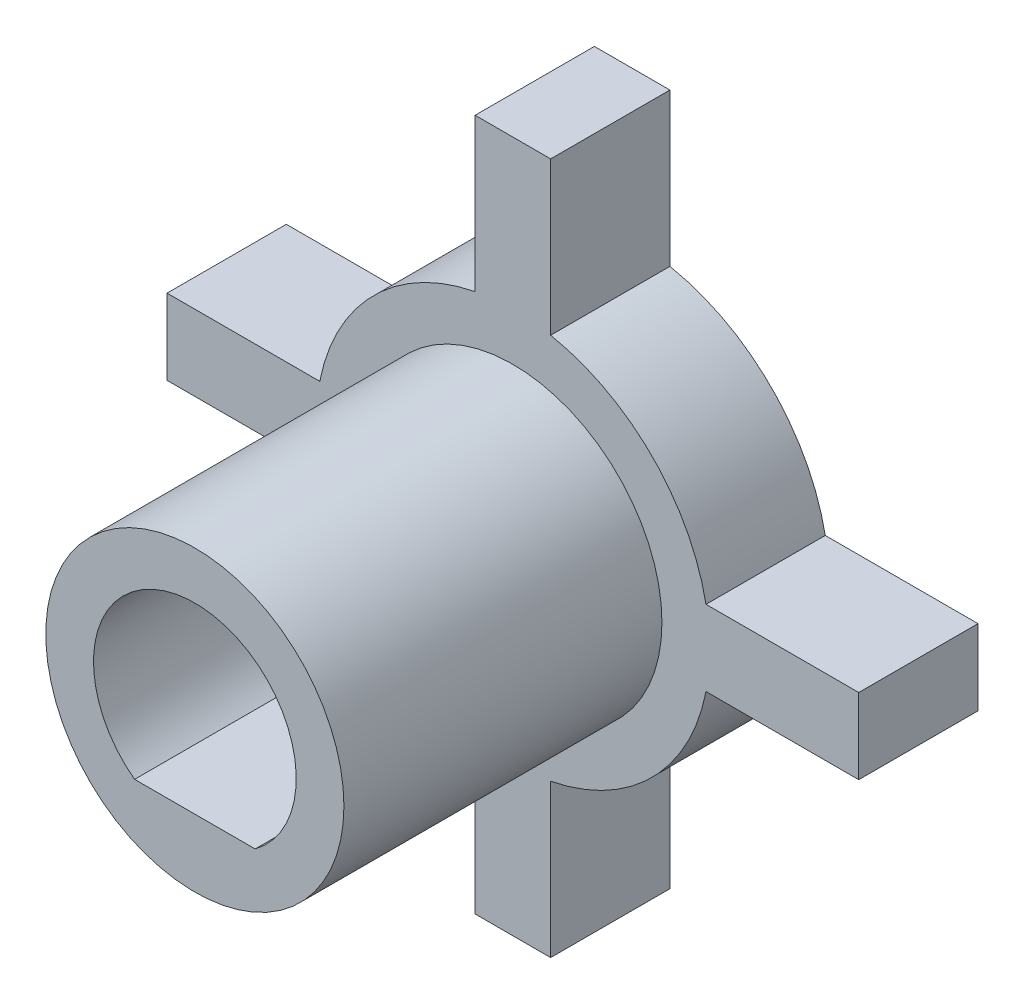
ISO-10303-21;
HEADER;
FILE_DESCRIPTION(('STEP AP214'),'2;1');
FILE_NAME('part.step','',(''),(''),'','','');
FILE_SCHEMA(('AUTOMOTIVE_DESIGN { 1 0 10303 214 1 1 1 1 }'));
ENDSEC;
DATA;
#1=APPLICATION_CONTEXT('core data for automotive mechanical design processes');
#2=APPLICATION_PROTOCOL_DEFINITION('international standard','automotive_design',2000,#1);
#3=PRODUCT_CONTEXT('',#1,'mechanical');
#4=PRODUCT('Part','Part','',(#3));
#5=PRODUCT_RELATED_PRODUCT_CATEGORY('part','',(#4));
#6=PRODUCT_DEFINITION_FORMATION('','',#4);
#7=PRODUCT_DEFINITION_CONTEXT('part definition',#1,'design');
#8=PRODUCT_DEFINITION('design','',#6,#7);
#9=PRODUCT_DEFINITION_SHAPE('','',#8);
#10=(LENGTH_UNIT() NAMED_UNIT(*) SI_UNIT(.MILLI.,.METRE.));
#11=(NAMED_UNIT(*) PLANE_ANGLE_UNIT() SI_UNIT($,.RADIAN.));
#12=(NAMED_UNIT(*) SI_UNIT($,.STERADIAN.) SOLID_ANGLE_UNIT());
#13=UNCERTAINTY_MEASURE_WITH_UNIT(LENGTH_MEASURE(1.E-05),#10,'distance_accuracy_value','');
#14=(GEOMETRIC_REPRESENTATION_CONTEXT(3) GLOBAL_UNCERTAINTY_ASSIGNED_CONTEXT((#13)) GLOBAL_UNIT_ASSIGNED_CONTEXT((#10,
#11,#12)) REPRESENTATION_CONTEXT('',''));
#15=CARTESIAN_POINT('',(0.,0.,0.));
#16=DIRECTION('',(0.,0.,1.));
#17=DIRECTION('',(1.,0.,0.));
#18=AXIS2_PLACEMENT_3D('',#15,#16,#17);
#19=CARTESIAN_POINT('',(1.9,9.71596624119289,6.));
#20=DIRECTION('',(-1.,0.,0.));
#21=DIRECTION('',(0.,0.,1.));
#22=AXIS2_PLACEMENT_3D('',#19,#20,#21);
#23=PLANE('',#22);
#24=DIRECTION('',(0.,1.,0.));
#25=VECTOR('',#24,1.);
#26=CARTESIAN_POINT('',(1.9,9.71596624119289,0.));
#27=LINE('',#26,#25);
#28=CARTESIAN_POINT('',(1.9,9.71596624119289,0.));
#29=VERTEX_POINT('',#28);
#30=CARTESIAN_POINT('',(1.9,17.4,0.));
#31=VERTEX_POINT('',#30);
#32=EDGE_CURVE('E184',#29,#31,#27,.T.);
#33=ORIENTED_EDGE('',*,*,#32,.T.);
#34=DIRECTION('',(0.,0.,-1.));
#35=VECTOR('',#34,1.);
#36=CARTESIAN_POINT('',(1.9,17.4,6.));
#37=LINE('',#36,#35);
#38=CARTESIAN_POINT('',(1.9,17.4,6.));
#39=VERTEX_POINT('',#38);
#40=EDGE_CURVE('E11',#39,#31,#37,.T.);
#41=ORIENTED_EDGE('',*,*,#40,.F.);
#42=DIRECTION('',(0.,1.,0.));
#43=VECTOR('',#42,1.);
#44=CARTESIAN_POINT('',(1.9,9.71596624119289,6.));
#45=LINE('',#44,#43);
#46=CARTESIAN_POINT('',(1.9,9.71596624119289,6.));
#47=VERTEX_POINT('',#46);
#48=EDGE_CURVE('E187',#47,#39,#45,.T.);
#49=ORIENTED_EDGE('',*,*,#48,.F.);
#50=DIRECTION('',(0.,0.,-1.));
#51=VECTOR('',#50,1.);
#52=CARTESIAN_POINT('',(1.9,9.71596624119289,6.));
#53=LINE('',#52,#51);
#54=EDGE_CURVE('E221',#47,#29,#53,.T.);
#55=ORIENTED_EDGE('',*,*,#54,.T.);
#56=EDGE_LOOP('',(#33,#41,#49,#55));
#57=FACE_BOUND('',#56,.T.);
#58=ADVANCED_FACE('F39',(#57),#23,.F.);
#59=CARTESIAN_POINT('',(-1.9,17.4,6.));
#60=DIRECTION('',(0.,-1.,0.));
#61=DIRECTION('',(0.,0.,-1.));
#62=AXIS2_PLACEMENT_3D('',#59,#60,#61);
#63=PLANE('',#62);
#64=DIRECTION('',(-1.,0.,0.));
#65=VECTOR('',#64,1.);
#66=CARTESIAN_POINT('',(-1.9,17.4,0.));
#67=LINE('',#66,#65);
#68=CARTESIAN_POINT('',(-1.9,17.4,0.));
#69=VERTEX_POINT('',#68);
#70=EDGE_CURVE('E224',#31,#69,#67,.T.);
#71=ORIENTED_EDGE('',*,*,#70,.T.);
#72=DIRECTION('',(0.,0.,-1.));
#73=VECTOR('',#72,1.);
#74=CARTESIAN_POINT('',(-1.9,17.4,6.));
#75=LINE('',#74,#73);
#76=CARTESIAN_POINT('',(-1.9,17.4,6.));
#77=VERTEX_POINT('',#76);
#78=EDGE_CURVE('E46',#77,#69,#75,.T.);
#79=ORIENTED_EDGE('',*,*,#78,.F.);
#80=DIRECTION('',(-1.,0.,0.));
#81=VECTOR('',#80,1.);
#82=CARTESIAN_POINT('',(-1.9,17.4,6.));
#83=LINE('',#82,#81);
#84=EDGE_CURVE('E190',#39,#77,#83,.T.);
#85=ORIENTED_EDGE('',*,*,#84,.F.);
#86=ORIENTED_EDGE('',*,*,#40,.T.);
#87=EDGE_LOOP('',(#71,#79,#85,#86));
#88=FACE_BOUND('',#87,.T.);
#89=ADVANCED_FACE('F319',(#88),#63,.F.);
#90=CARTESIAN_POINT('',(-1.9,9.71596624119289,6.));
#91=DIRECTION('',(1.,0.,0.));
#92=DIRECTION('',(0.,0.,-1.));
#93=AXIS2_PLACEMENT_3D('',#90,#91,#92);
#94=PLANE('',#93);
#95=DIRECTION('',(0.,-1.,0.));
#96=VECTOR('',#95,1.);
#97=CARTESIAN_POINT('',(-1.9,9.71596624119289,0.));
#98=LINE('',#97,#96);
#99=CARTESIAN_POINT('',(-1.9,9.71596624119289,0.));
#100=VERTEX_POINT('',#99);
#101=EDGE_CURVE('E226',#69,#100,#98,.T.);
#102=ORIENTED_EDGE('',*,*,#101,.T.);
#103=DIRECTION('',(0.,0.,-1.));
#104=VECTOR('',#103,1.);
#105=CARTESIAN_POINT('',(-1.9,9.71596624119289,6.));
#106=LINE('',#105,#104);
#107=CARTESIAN_POINT('',(-1.9,9.71596624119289,6.));
#108=VERTEX_POINT('',#107);
#109=EDGE_CURVE('E291',#108,#100,#106,.T.);
#110=ORIENTED_EDGE('',*,*,#109,.F.);
#111=DIRECTION('',(0.,-1.,0.));
#112=VECTOR('',#111,1.);
#113=CARTESIAN_POINT('',(-1.9,9.71596624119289,6.));
#114=LINE('',#113,#112);
#115=EDGE_CURVE('E193',#77,#108,#114,.T.);
#116=ORIENTED_EDGE('',*,*,#115,.F.);
#117=ORIENTED_EDGE('',*,*,#78,.T.);
#118=EDGE_LOOP('',(#102,#110,#116,#117));
#119=FACE_BOUND('',#118,.T.);
#120=ADVANCED_FACE('F298',(#119),#94,.F.);
#121=CARTESIAN_POINT('',(0.,0.,6.));
#122=DIRECTION('',(0.,0.,-1.));
#123=DIRECTION('',(-1.,0.,0.));
#124=AXIS2_PLACEMENT_3D('',#121,#122,#123);
#125=CYLINDRICAL_SURFACE('',#124,9.9);
#126=CARTESIAN_POINT('',(0.,0.,0.));
#127=DIRECTION('',(0.,0.,1.));
#128=DIRECTION('',(1.,0.,0.));
#129=AXIS2_PLACEMENT_3D('',#126,#127,#128);
#130=CIRCLE('',#129,9.9);
#131=CARTESIAN_POINT('',(-9.71596624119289,1.9,0.));
#132=VERTEX_POINT('',#131);
#133=EDGE_CURVE('E228',#100,#132,#130,.T.);
#134=ORIENTED_EDGE('',*,*,#133,.T.);
#135=DIRECTION('',(0.,0.,-1.));
#136=VECTOR('',#135,1.);
#137=CARTESIAN_POINT('',(-9.71596624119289,1.9,6.));
#138=LINE('',#137,#136);
#139=CARTESIAN_POINT('',(-9.71596624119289,1.9,6.));
#140=VERTEX_POINT('',#139);
#141=EDGE_CURVE('E288',#140,#132,#138,.T.);
#142=ORIENTED_EDGE('',*,*,#141,.F.);
#143=CARTESIAN_POINT('',(0.,0.,6.));
#144=DIRECTION('',(0.,0.,1.));
#145=DIRECTION('',(1.,0.,0.));
#146=AXIS2_PLACEMENT_3D('',#143,#144,#145);
#147=CIRCLE('',#146,9.9);
#148=EDGE_CURVE('E195',#108,#140,#147,.T.);
#149=ORIENTED_EDGE('',*,*,#148,.F.);
#150=ORIENTED_EDGE('',*,*,#109,.T.);
#151=EDGE_LOOP('',(#134,#142,#149,#150));
#152=FACE_BOUND('',#151,.T.);
#153=ADVANCED_FACE('F307',(#152),#125,.T.);
#154=CARTESIAN_POINT('',(-17.4,1.9,6.));
#155=DIRECTION('',(0.,-1.,0.));
#156=DIRECTION('',(0.,0.,-1.));
#157=AXIS2_PLACEMENT_3D('',#154,#155,#156);
#158=PLANE('',#157);
#159=DIRECTION('',(-1.,0.,0.));
#160=VECTOR('',#159,1.);
#161=CARTESIAN_POINT('',(-17.4,1.9,0.));
#162=LINE('',#161,#160);
#163=CARTESIAN_POINT('',(-17.4,1.9,0.));
#164=VERTEX_POINT('',#163);
#165=EDGE_CURVE('E230',#132,#164,#162,.T.);
#166=ORIENTED_EDGE('',*,*,#165,.T.);
#167=DIRECTION('',(0.,0.,-1.));
#168=VECTOR('',#167,1.);
#169=CARTESIAN_POINT('',(-17.4,1.9,6.));
#170=LINE('',#169,#168);
#171=CARTESIAN_POINT('',(-17.4,1.9,6.));
#172=VERTEX_POINT('',#171);
#173=EDGE_CURVE('E285',#172,#164,#170,.T.);
#174=ORIENTED_EDGE('',*,*,#173,.F.);
#175=DIRECTION('',(-1.,0.,0.));
#176=VECTOR('',#175,1.);
#177=CARTESIAN_POINT('',(-17.4,1.9,6.));
#178=LINE('',#177,#176);
#179=EDGE_CURVE('E197',#140,#172,#178,.T.);
#180=ORIENTED_EDGE('',*,*,#179,.F.);
#181=ORIENTED_EDGE('',*,*,#141,.T.);
#182=EDGE_LOOP('',(#166,#174,#180,#181));
#183=FACE_BOUND('',#182,.T.);
#184=ADVANCED_FACE('F311',(#183),#158,.F.);
#185=CARTESIAN_POINT('',(-17.4,1.9,6.));
#186=DIRECTION('',(1.,0.,0.));
#187=DIRECTION('',(0.,0.,-1.));
#188=AXIS2_PLACEMENT_3D('',#185,#186,#187);
#189=PLANE('',#188);
#190=DIRECTION('',(0.,-1.,0.));
#191=VECTOR('',#190,1.);
#192=CARTESIAN_POINT('',(-17.4,1.9,0.));
#193=LINE('',#192,#191);
#194=CARTESIAN_POINT('',(-17.4,-1.9,0.));
#195=VERTEX_POINT('',#194);
#196=EDGE_CURVE('E232',#164,#195,#193,.T.);
#197=ORIENTED_EDGE('',*,*,#196,.T.);
#198=DIRECTION('',(0.,0.,-1.));
#199=VECTOR('',#198,1.);
#200=CARTESIAN_POINT('',(-17.4,-1.9,6.));
#201=LINE('',#200,#199);
#202=CARTESIAN_POINT('',(-17.4,-1.9,6.));
#203=VERTEX_POINT('',#202);
#204=EDGE_CURVE('E282',#203,#195,#201,.T.);
#205=ORIENTED_EDGE('',*,*,#204,.F.);
#206=DIRECTION('',(0.,-1.,0.));
#207=VECTOR('',#206,1.);
#208=CARTESIAN_POINT('',(-17.4,1.9,6.));
#209=LINE('',#208,#207);
#210=EDGE_CURVE('E199',#172,#203,#209,.T.);
#211=ORIENTED_EDGE('',*,*,#210,.F.);
#212=ORIENTED_EDGE('',*,*,#173,.T.);
#213=EDGE_LOOP('',(#197,#205,#211,#212));
#214=FACE_BOUND('',#213,.T.);
#215=ADVANCED_FACE('F372',(#214),#189,.F.);
#216=CARTESIAN_POINT('',(-17.4,-1.9,6.));
#217=DIRECTION('',(0.,1.,0.));
#218=DIRECTION('',(0.,0.,1.));
#219=AXIS2_PLACEMENT_3D('',#216,#217,#218);
#220=PLANE('',#219);
#221=DIRECTION('',(1.,0.,0.));
#222=VECTOR('',#221,1.);
#223=CARTESIAN_POINT('',(-17.4,-1.9,0.));
#224=LINE('',#223,#222);
#225=CARTESIAN_POINT('',(-9.71596624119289,-1.9,0.));
#226=VERTEX_POINT('',#225);
#227=EDGE_CURVE('E234',#195,#226,#224,.T.);
#228=ORIENTED_EDGE('',*,*,#227,.T.);
#229=DIRECTION('',(0.,0.,-1.));
#230=VECTOR('',#229,1.);
#231=CARTESIAN_POINT('',(-9.71596624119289,-1.9,6.));
#232=LINE('',#231,#230);
#233=CARTESIAN_POINT('',(-9.71596624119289,-1.9,6.));
#234=VERTEX_POINT('',#233);
#235=EDGE_CURVE('E279',#234,#226,#232,.T.);
#236=ORIENTED_EDGE('',*,*,#235,.F.);
#237=DIRECTION('',(1.,0.,0.));
#238=VECTOR('',#237,1.);
#239=CARTESIAN_POINT('',(-17.4,-1.9,6.));
#240=LINE('',#239,#238);
#241=EDGE_CURVE('E201',#203,#234,#240,.T.);
#242=ORIENTED_EDGE('',*,*,#241,.F.);
#243=ORIENTED_EDGE('',*,*,#204,.T.);
#244=EDGE_LOOP('',(#228,#236,#242,#243));
#245=FACE_BOUND('',#244,.T.);
#246=ADVANCED_FACE('F369',(#245),#220,.F.);
#247=CARTESIAN_POINT('',(0.,0.,6.));
#248=DIRECTION('',(0.,0.,-1.));
#249=DIRECTION('',(-1.,0.,0.));
#250=AXIS2_PLACEMENT_3D('',#247,#248,#249);
#251=CYLINDRICAL_SURFACE('',#250,9.9);
#252=CARTESIAN_POINT('',(0.,0.,0.));
#253=DIRECTION('',(0.,0.,1.));
#254=DIRECTION('',(1.,0.,0.));
#255=AXIS2_PLACEMENT_3D('',#252,#253,#254);
#256=CIRCLE('',#255,9.9);
#257=CARTESIAN_POINT('',(-1.90000000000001,-9.71596624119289,0.));
#258=VERTEX_POINT('',#257);
#259=EDGE_CURVE('E236',#226,#258,#256,.T.);
#260=ORIENTED_EDGE('',*,*,#259,.T.);
#261=DIRECTION('',(0.,0.,-1.));
#262=VECTOR('',#261,1.);
#263=CARTESIAN_POINT('',(-1.90000000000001,-9.71596624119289,6.));
#264=LINE('',#263,#262);
#265=CARTESIAN_POINT('',(-1.90000000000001,-9.71596624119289,6.));
#266=VERTEX_POINT('',#265);
#267=EDGE_CURVE('E276',#266,#258,#264,.T.);
#268=ORIENTED_EDGE('',*,*,#267,.F.);
#269=CARTESIAN_POINT('',(0.,0.,6.));
#270=DIRECTION('',(0.,0.,1.));
#271=DIRECTION('',(1.,0.,0.));
#272=AXIS2_PLACEMENT_3D('',#269,#270,#271);
#273=CIRCLE('',#272,9.9);
#274=EDGE_CURVE('E203',#234,#266,#273,.T.);
#275=ORIENTED_EDGE('',*,*,#274,.F.);
#276=ORIENTED_EDGE('',*,*,#235,.T.);
#277=EDGE_LOOP('',(#260,#268,#275,#276));
#278=FACE_BOUND('',#277,.T.);
#279=ADVANCED_FACE('F365',(#278),#251,.T.);
#280=CARTESIAN_POINT('',(-1.9,-17.4,6.));
#281=DIRECTION('',(1.,0.,0.));
#282=DIRECTION('',(0.,0.,-1.));
#283=AXIS2_PLACEMENT_3D('',#280,#281,#282);
#284=PLANE('',#283);
#285=DIRECTION('',(0.,-1.,0.));
#286=VECTOR('',#285,1.);
#287=CARTESIAN_POINT('',(-1.9,-17.4,0.));
#288=LINE('',#287,#286);
#289=CARTESIAN_POINT('',(-1.9,-17.4,0.));
#290=VERTEX_POINT('',#289);
#291=EDGE_CURVE('E238',#258,#290,#288,.T.);
#292=ORIENTED_EDGE('',*,*,#291,.T.);
#293=DIRECTION('',(0.,0.,-1.));
#294=VECTOR('',#293,1.);
#295=CARTESIAN_POINT('',(-1.9,-17.4,6.));
#296=LINE('',#295,#294);
#297=CARTESIAN_POINT('',(-1.9,-17.4,6.));
#298=VERTEX_POINT('',#297);
#299=EDGE_CURVE('E273',#298,#290,#296,.T.);
#300=ORIENTED_EDGE('',*,*,#299,.F.);
#301=DIRECTION('',(0.,-1.,0.));
#302=VECTOR('',#301,1.);
#303=CARTESIAN_POINT('',(-1.9,-17.4,6.));
#304=LINE('',#303,#302);
#305=EDGE_CURVE('E205',#266,#298,#304,.T.);
#306=ORIENTED_EDGE('',*,*,#305,.F.);
#307=ORIENTED_EDGE('',*,*,#267,.T.);
#308=EDGE_LOOP('',(#292,#300,#306,#307));
#309=FACE_BOUND('',#308,.T.);
#310=ADVANCED_FACE('F361',(#309),#284,.F.);
#311=CARTESIAN_POINT('',(-1.9,-17.4,6.));
#312=DIRECTION('',(0.,1.,0.));
#313=DIRECTION('',(0.,0.,1.));
#314=AXIS2_PLACEMENT_3D('',#311,#312,#313);
#315=PLANE('',#314);
#316=DIRECTION('',(1.,0.,0.));
#317=VECTOR('',#316,1.);
#318=CARTESIAN_POINT('',(-1.9,-17.4,0.));
#319=LINE('',#318,#317);
#320=CARTESIAN_POINT('',(1.9,-17.4,0.));
#321=VERTEX_POINT('',#320);
#322=EDGE_CURVE('E240',#290,#321,#319,.T.);
#323=ORIENTED_EDGE('',*,*,#322,.T.);
#324=DIRECTION('',(0.,0.,-1.));
#325=VECTOR('',#324,1.);
#326=CARTESIAN_POINT('',(1.9,-17.4,6.));
#327=LINE('',#326,#325);
#328=CARTESIAN_POINT('',(1.9,-17.4,6.));
#329=VERTEX_POINT('',#328);
#330=EDGE_CURVE('E270',#329,#321,#327,.T.);
#331=ORIENTED_EDGE('',*,*,#330,.F.);
#332=DIRECTION('',(1.,0.,0.));
#333=VECTOR('',#332,1.);
#334=CARTESIAN_POINT('',(-1.9,-17.4,6.));
#335=LINE('',#334,#333);
#336=EDGE_CURVE('E207',#298,#329,#335,.T.);
#337=ORIENTED_EDGE('',*,*,#336,.F.);
#338=ORIENTED_EDGE('',*,*,#299,.T.);
#339=EDGE_LOOP('',(#323,#331,#337,#338));
#340=FACE_BOUND('',#339,.T.);
#341=ADVANCED_FACE('F356',(#340),#315,.F.);
#342=CARTESIAN_POINT('',(1.9,-17.4,6.));
#343=DIRECTION('',(-1.,0.,0.));
#344=DIRECTION('',(0.,0.,1.));
#345=AXIS2_PLACEMENT_3D('',#342,#343,#344);
#346=PLANE('',#345);
#347=DIRECTION('',(0.,1.,0.));
#348=VECTOR('',#347,1.);
#349=CARTESIAN_POINT('',(1.9,-17.4,0.));
#350=LINE('',#349,#348);
#351=CARTESIAN_POINT('',(1.9,-9.71596624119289,0.));
#352=VERTEX_POINT('',#351);
#353=EDGE_CURVE('E242',#321,#352,#350,.T.);
#354=ORIENTED_EDGE('',*,*,#353,.T.);
#355=DIRECTION('',(0.,0.,-1.));
#356=VECTOR('',#355,1.);
#357=CARTESIAN_POINT('',(1.9,-9.71596624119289,6.));
#358=LINE('',#357,#356);
#359=CARTESIAN_POINT('',(1.9,-9.71596624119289,6.));
#360=VERTEX_POINT('',#359);
#361=EDGE_CURVE('E267',#360,#352,#358,.T.);
#362=ORIENTED_EDGE('',*,*,#361,.F.);
#363=DIRECTION('',(0.,1.,0.));
#364=VECTOR('',#363,1.);
#365=CARTESIAN_POINT('',(1.9,-17.4,6.));
#366=LINE('',#365,#364);
#367=EDGE_CURVE('E209',#329,#360,#366,.T.);
#368=ORIENTED_EDGE('',*,*,#367,.F.);
#369=ORIENTED_EDGE('',*,*,#330,.T.);
#370=EDGE_LOOP('',(#354,#362,#368,#369));
#371=FACE_BOUND('',#370,.T.);
#372=ADVANCED_FACE('F350',(#371),#346,.F.);
#373=CARTESIAN_POINT('',(0.,0.,6.));
#374=DIRECTION('',(0.,0.,-1.));
#375=DIRECTION('',(-1.,0.,0.));
#376=AXIS2_PLACEMENT_3D('',#373,#374,#375);
#377=CYLINDRICAL_SURFACE('',#376,9.9);
#378=CARTESIAN_POINT('',(0.,0.,0.));
#379=DIRECTION('',(0.,0.,1.));
#380=DIRECTION('',(1.,0.,0.));
#381=AXIS2_PLACEMENT_3D('',#378,#379,#380);
#382=CIRCLE('',#381,9.9);
#383=CARTESIAN_POINT('',(9.71596624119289,-1.90000000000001,0.));
#384=VERTEX_POINT('',#383);
#385=EDGE_CURVE('E244',#352,#384,#382,.T.);
#386=ORIENTED_EDGE('',*,*,#385,.T.);
#387=DIRECTION('',(0.,0.,-1.));
#388=VECTOR('',#387,1.);
#389=CARTESIAN_POINT('',(9.71596624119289,-1.90000000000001,6.));
#390=LINE('',#389,#388);
#391=CARTESIAN_POINT('',(9.71596624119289,-1.90000000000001,6.));
#392=VERTEX_POINT('',#391);
#393=EDGE_CURVE('E264',#392,#384,#390,.T.);
#394=ORIENTED_EDGE('',*,*,#393,.F.);
#395=CARTESIAN_POINT('',(0.,0.,6.));
#396=DIRECTION('',(0.,0.,1.));
#397=DIRECTION('',(1.,0.,0.));
#398=AXIS2_PLACEMENT_3D('',#395,#396,#397);
#399=CIRCLE('',#398,9.9);
#400=EDGE_CURVE('E211',#360,#392,#399,.T.);
#401=ORIENTED_EDGE('',*,*,#400,.F.);
#402=ORIENTED_EDGE('',*,*,#361,.T.);
#403=EDGE_LOOP('',(#386,#394,#401,#402));
#404=FACE_BOUND('',#403,.T.);
#405=ADVANCED_FACE('F346',(#404),#377,.T.);
#406=CARTESIAN_POINT('',(9.71596624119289,-1.9,6.));
#407=DIRECTION('',(0.,1.,0.));
#408=DIRECTION('',(0.,0.,1.));
#409=AXIS2_PLACEMENT_3D('',#406,#407,#408);
#410=PLANE('',#409);
#411=DIRECTION('',(1.,0.,0.));
#412=VECTOR('',#411,1.);
#413=CARTESIAN_POINT('',(9.71596624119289,-1.9,0.));
#414=LINE('',#413,#412);
#415=CARTESIAN_POINT('',(17.4,-1.9,0.));
#416=VERTEX_POINT('',#415);
#417=EDGE_CURVE('E246',#384,#416,#414,.T.);
#418=ORIENTED_EDGE('',*,*,#417,.T.);
#419=DIRECTION('',(0.,0.,-1.));
#420=VECTOR('',#419,1.);
#421=CARTESIAN_POINT('',(17.4,-1.9,6.));
#422=LINE('',#421,#420);
#423=CARTESIAN_POINT('',(17.4,-1.9,6.));
#424=VERTEX_POINT('',#423);
#425=EDGE_CURVE('E261',#424,#416,#422,.T.);
#426=ORIENTED_EDGE('',*,*,#425,.F.);
#427=DIRECTION('',(1.,0.,0.));
#428=VECTOR('',#427,1.);
#429=CARTESIAN_POINT('',(9.71596624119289,-1.9,6.));
#430=LINE('',#429,#428);
#431=EDGE_CURVE('E213',#392,#424,#430,.T.);
#432=ORIENTED_EDGE('',*,*,#431,.F.);
#433=ORIENTED_EDGE('',*,*,#393,.T.);
#434=EDGE_LOOP('',(#418,#426,#432,#433));
#435=FACE_BOUND('',#434,.T.);
#436=ADVANCED_FACE('F341',(#435),#410,.F.);
#437=CARTESIAN_POINT('',(17.4,1.9,6.));
#438=DIRECTION('',(-1.,0.,0.));
#439=DIRECTION('',(0.,0.,1.));
#440=AXIS2_PLACEMENT_3D('',#437,#438,#439);
#441=PLANE('',#440);
#442=DIRECTION('',(0.,1.,0.));
#443=VECTOR('',#442,1.);
#444=CARTESIAN_POINT('',(17.4,1.9,0.));
#445=LINE('',#444,#443);
#446=CARTESIAN_POINT('',(17.4,1.9,0.));
#447=VERTEX_POINT('',#446);
#448=EDGE_CURVE('E248',#416,#447,#445,.T.);
#449=ORIENTED_EDGE('',*,*,#448,.T.);
#450=DIRECTION('',(0.,0.,-1.));
#451=VECTOR('',#450,1.);
#452=CARTESIAN_POINT('',(17.4,1.9,6.));
#453=LINE('',#452,#451);
#454=CARTESIAN_POINT('',(17.4,1.9,6.));
#455=VERTEX_POINT('',#454);
#456=EDGE_CURVE('E258',#455,#447,#453,.T.);
#457=ORIENTED_EDGE('',*,*,#456,.F.);
#458=DIRECTION('',(0.,1.,0.));
#459=VECTOR('',#458,1.);
#460=CARTESIAN_POINT('',(17.4,1.9,6.));
#461=LINE('',#460,#459);
#462=EDGE_CURVE('E215',#424,#455,#461,.T.);
#463=ORIENTED_EDGE('',*,*,#462,.F.);
#464=ORIENTED_EDGE('',*,*,#425,.T.);
#465=EDGE_LOOP('',(#449,#457,#463,#464));
#466=FACE_BOUND('',#465,.T.);
#467=ADVANCED_FACE('F335',(#466),#441,.F.);
#468=CARTESIAN_POINT('',(9.71596624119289,1.9,6.));
#469=DIRECTION('',(0.,-1.,0.));
#470=DIRECTION('',(0.,0.,-1.));
#471=AXIS2_PLACEMENT_3D('',#468,#469,#470);
#472=PLANE('',#471);
#473=DIRECTION('',(-1.,0.,0.));
#474=VECTOR('',#473,1.);
#475=CARTESIAN_POINT('',(9.71596624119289,1.9,0.));
#476=LINE('',#475,#474);
#477=CARTESIAN_POINT('',(9.71596624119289,1.9,0.));
#478=VERTEX_POINT('',#477);
#479=EDGE_CURVE('E250',#447,#478,#476,.T.);
#480=ORIENTED_EDGE('',*,*,#479,.T.);
#481=DIRECTION('',(0.,0.,-1.));
#482=VECTOR('',#481,1.);
#483=CARTESIAN_POINT('',(9.71596624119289,1.9,6.));
#484=LINE('',#483,#482);
#485=CARTESIAN_POINT('',(9.71596624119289,1.9,6.));
#486=VERTEX_POINT('',#485);
#487=EDGE_CURVE('E255',#486,#478,#484,.T.);
#488=ORIENTED_EDGE('',*,*,#487,.F.);
#489=DIRECTION('',(-1.,0.,0.));
#490=VECTOR('',#489,1.);
#491=CARTESIAN_POINT('',(9.71596624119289,1.9,6.));
#492=LINE('',#491,#490);
#493=EDGE_CURVE('E217',#455,#486,#492,.T.);
#494=ORIENTED_EDGE('',*,*,#493,.F.);
#495=ORIENTED_EDGE('',*,*,#456,.T.);
#496=EDGE_LOOP('',(#480,#488,#494,#495));
#497=FACE_BOUND('',#496,.T.);
#498=ADVANCED_FACE('F331',(#497),#472,.F.);
#499=CARTESIAN_POINT('',(0.,0.,6.));
#500=DIRECTION('',(0.,0.,-1.));
#501=DIRECTION('',(-1.,0.,0.));
#502=AXIS2_PLACEMENT_3D('',#499,#500,#501);
#503=CYLINDRICAL_SURFACE('',#502,9.9);
#504=CARTESIAN_POINT('',(0.,0.,0.));
#505=DIRECTION('',(0.,0.,1.));
#506=DIRECTION('',(1.,0.,0.));
#507=AXIS2_PLACEMENT_3D('',#504,#505,#506);
#508=CIRCLE('',#507,9.9);
#509=EDGE_CURVE('E191',#478,#29,#508,.T.);
#510=ORIENTED_EDGE('',*,*,#509,.T.);
#511=ORIENTED_EDGE('',*,*,#54,.F.);
#512=CARTESIAN_POINT('',(0.,0.,6.));
#513=DIRECTION('',(0.,0.,1.));
#514=DIRECTION('',(1.,0.,0.));
#515=AXIS2_PLACEMENT_3D('',#512,#513,#514);
#516=CIRCLE('',#515,9.9);
#517=EDGE_CURVE('E219',#486,#47,#516,.T.);
#518=ORIENTED_EDGE('',*,*,#517,.F.);
#519=ORIENTED_EDGE('',*,*,#487,.T.);
#520=EDGE_LOOP('',(#510,#511,#518,#519));
#521=FACE_BOUND('',#520,.T.);
#522=ADVANCED_FACE('F326',(#521),#503,.T.);
#523=CARTESIAN_POINT('',(0.,0.,6.));
#524=DIRECTION('',(0.,0.,1.));
#525=DIRECTION('',(1.,0.,0.));
#526=AXIS2_PLACEMENT_3D('',#523,#524,#525);
#527=PLANE('',#526);
#528=CARTESIAN_POINT('',(0.,0.,6.));
#529=DIRECTION('',(0.,0.,1.));
#530=DIRECTION('',(1.,0.,0.));
#531=AXIS2_PLACEMENT_3D('',#528,#529,#530);
#532=CIRCLE('',#531,7.5);
#533=CARTESIAN_POINT('',(7.5,0.,6.));
#534=VERTEX_POINT('',#533);
#535=EDGE_CURVE('E179',#534,#534,#532,.T.);
#536=ORIENTED_EDGE('',*,*,#535,.F.);
#537=EDGE_LOOP('',(#536));
#538=FACE_BOUND('',#537,.T.);
#539=ORIENTED_EDGE('',*,*,#48,.T.);
#540=ORIENTED_EDGE('',*,*,#84,.T.);
#541=ORIENTED_EDGE('',*,*,#115,.T.);
#542=ORIENTED_EDGE('',*,*,#148,.T.);
#543=ORIENTED_EDGE('',*,*,#179,.T.);
#544=ORIENTED_EDGE('',*,*,#210,.T.);
#545=ORIENTED_EDGE('',*,*,#241,.T.);
#546=ORIENTED_EDGE('',*,*,#274,.T.);
#547=ORIENTED_EDGE('',*,*,#305,.T.);
#548=ORIENTED_EDGE('',*,*,#336,.T.);
#549=ORIENTED_EDGE('',*,*,#367,.T.);
#550=ORIENTED_EDGE('',*,*,#400,.T.);
#551=ORIENTED_EDGE('',*,*,#431,.T.);
#552=ORIENTED_EDGE('',*,*,#462,.T.);
#553=ORIENTED_EDGE('',*,*,#493,.T.);
#554=ORIENTED_EDGE('',*,*,#517,.T.);
#555=EDGE_LOOP('',(#539,#540,#541,#542,#543,#544,#545,#546,#547,#548,#549,#550,#551,#552,#553,#554));
#556=FACE_BOUND('',#555,.T.);
#557=ADVANCED_FACE('F315',(#538,#556),#527,.T.);
#558=CARTESIAN_POINT('',(0.,0.,0.));
#559=DIRECTION('',(0.,0.,1.));
#560=DIRECTION('',(1.,0.,0.));
#561=AXIS2_PLACEMENT_3D('',#558,#559,#560);
#562=PLANE('',#561);
#563=DIRECTION('',(1.,0.,0.));
#564=VECTOR('',#563,1.);
#565=CARTESIAN_POINT('',(-3.03315017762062,-4.1,0.));
#566=LINE('',#565,#564);
#567=CARTESIAN_POINT('',(-3.03315017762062,-4.1,0.));
#568=VERTEX_POINT('',#567);
#569=CARTESIAN_POINT('',(3.03315017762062,-4.1,0.));
#570=VERTEX_POINT('',#569);
#571=EDGE_CURVE('E166',#568,#570,#566,.T.);
#572=ORIENTED_EDGE('',*,*,#571,.T.);
#573=CARTESIAN_POINT('',(0.,0.,0.));
#574=DIRECTION('',(0.,0.,1.));
#575=DIRECTION('',(1.,0.,0.));
#576=AXIS2_PLACEMENT_3D('',#573,#574,#575);
#577=CIRCLE('',#576,5.1);
#578=EDGE_CURVE('E53',#570,#568,#577,.T.);
#579=ORIENTED_EDGE('',*,*,#578,.T.);
#580=EDGE_LOOP('',(#572,#579));
#581=FACE_BOUND('',#580,.T.);
#582=ORIENTED_EDGE('',*,*,#32,.F.);
#583=ORIENTED_EDGE('',*,*,#509,.F.);
#584=ORIENTED_EDGE('',*,*,#479,.F.);
#585=ORIENTED_EDGE('',*,*,#448,.F.);
#586=ORIENTED_EDGE('',*,*,#417,.F.);
#587=ORIENTED_EDGE('',*,*,#385,.F.);
#588=ORIENTED_EDGE('',*,*,#353,.F.);
#589=ORIENTED_EDGE('',*,*,#322,.F.);
#590=ORIENTED_EDGE('',*,*,#291,.F.);
#591=ORIENTED_EDGE('',*,*,#259,.F.);
#592=ORIENTED_EDGE('',*,*,#227,.F.);
#593=ORIENTED_EDGE('',*,*,#196,.F.);
#594=ORIENTED_EDGE('',*,*,#165,.F.);
#595=ORIENTED_EDGE('',*,*,#133,.F.);
#596=ORIENTED_EDGE('',*,*,#101,.F.);
#597=ORIENTED_EDGE('',*,*,#70,.F.);
#598=EDGE_LOOP('',(#582,#583,#584,#585,#586,#587,#588,#589,#590,#591,#592,#593,#594,#595,#596,#597));
#599=FACE_BOUND('',#598,.T.);
#600=ADVANCED_FACE('F172',(#581,#599),#562,.F.);
#601=CARTESIAN_POINT('',(0.,0.,22.));
#602=DIRECTION('',(0.,0.,-1.));
#603=DIRECTION('',(-1.,0.,0.));
#604=AXIS2_PLACEMENT_3D('',#601,#602,#603);
#605=CYLINDRICAL_SURFACE('',#604,7.5);
#606=CARTESIAN_POINT('',(0.,0.,22.));
#607=DIRECTION('',(0.,0.,1.));
#608=DIRECTION('',(1.,0.,0.));
#609=AXIS2_PLACEMENT_3D('',#606,#607,#608);
#610=CIRCLE('',#609,7.5);
#611=CARTESIAN_POINT('',(7.5,0.,22.));
#612=VERTEX_POINT('',#611);
#613=EDGE_CURVE('E181',#612,#612,#610,.T.);
#614=ORIENTED_EDGE('',*,*,#613,.F.);
#615=EDGE_LOOP('',(#614));
#616=FACE_BOUND('',#615,.T.);
#617=ORIENTED_EDGE('',*,*,#535,.T.);
#618=EDGE_LOOP('',(#617));
#619=FACE_BOUND('',#618,.T.);
#620=ADVANCED_FACE('F510',(#616,#619),#605,.T.);
#621=CARTESIAN_POINT('',(0.,0.,22.));
#622=DIRECTION('',(0.,0.,1.));
#623=DIRECTION('',(1.,0.,0.));
#624=AXIS2_PLACEMENT_3D('',#621,#622,#623);
#625=PLANE('',#624);
#626=CARTESIAN_POINT('',(0.,0.,22.));
#627=DIRECTION('',(0.,0.,1.));
#628=DIRECTION('',(1.,0.,0.));
#629=AXIS2_PLACEMENT_3D('',#626,#627,#628);
#630=CIRCLE('',#629,5.1);
#631=CARTESIAN_POINT('',(3.03315017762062,-4.1,22.));
#632=VERTEX_POINT('',#631);
#633=CARTESIAN_POINT('',(-3.03315017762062,-4.1,22.));
#634=VERTEX_POINT('',#633);
#635=EDGE_CURVE('E58',#632,#634,#630,.T.);
#636=ORIENTED_EDGE('',*,*,#635,.F.);
#637=DIRECTION('',(1.,0.,0.));
#638=VECTOR('',#637,1.);
#639=CARTESIAN_POINT('',(-3.03315017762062,-4.1,22.));
#640=LINE('',#639,#638);
#641=EDGE_CURVE('E174',#634,#632,#640,.T.);
#642=ORIENTED_EDGE('',*,*,#641,.F.);
#643=EDGE_LOOP('',(#636,#642));
#644=FACE_BOUND('',#643,.T.);
#645=ORIENTED_EDGE('',*,*,#613,.T.);
#646=EDGE_LOOP('',(#645));
#647=FACE_BOUND('',#646,.T.);
#648=ADVANCED_FACE('F515',(#644,#647),#625,.T.);
#649=CARTESIAN_POINT('',(0.,0.,0.));
#650=DIRECTION('',(0.,0.,1.));
#651=DIRECTION('',(1.,0.,0.));
#652=AXIS2_PLACEMENT_3D('',#649,#650,#651);
#653=CYLINDRICAL_SURFACE('',#652,5.1);
#654=ORIENTED_EDGE('',*,*,#635,.T.);
#655=DIRECTION('',(0.,0.,1.));
#656=VECTOR('',#655,1.);
#657=CARTESIAN_POINT('',(-3.03315017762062,-4.1,0.));
#658=LINE('',#657,#656);
#659=EDGE_CURVE('E159',#568,#634,#658,.T.);
#660=ORIENTED_EDGE('',*,*,#659,.F.);
#661=ORIENTED_EDGE('',*,*,#578,.F.);
#662=DIRECTION('',(0.,0.,1.));
#663=VECTOR('',#662,1.);
#664=CARTESIAN_POINT('',(3.03315017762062,-4.1,0.));
#665=LINE('',#664,#663);
#666=EDGE_CURVE('E165',#570,#632,#665,.T.);
#667=ORIENTED_EDGE('',*,*,#666,.T.);
#668=EDGE_LOOP('',(#654,#660,#661,#667));
#669=FACE_BOUND('',#668,.T.);
#670=ADVANCED_FACE('F161',(#669),#653,.F.);
#671=CARTESIAN_POINT('',(-3.03315017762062,-4.1,0.));
#672=DIRECTION('',(0.,-1.,0.));
#673=DIRECTION('',(0.,0.,-1.));
#674=AXIS2_PLACEMENT_3D('',#671,#672,#673);
#675=PLANE('',#674);
#676=ORIENTED_EDGE('',*,*,#641,.T.);
#677=ORIENTED_EDGE('',*,*,#666,.F.);
#678=ORIENTED_EDGE('',*,*,#571,.F.);
#679=ORIENTED_EDGE('',*,*,#659,.T.);
#680=EDGE_LOOP('',(#676,#677,#678,#679));
#681=FACE_BOUND('',#680,.T.);
#682=ADVANCED_FACE('F169',(#681),#675,.F.);
#683=CLOSED_SHELL('',(#58,#89,#120,#153,#184,#215,#246,#279,#310,#341,#372,#405,#436,#467,#498,
#522,#557,#600,#620,#648,#670,#682));
#684=MANIFOLD_SOLID_BREP('B2',#683);
#685=ADVANCED_BREP_SHAPE_REPRESENTATION('',(#18,#684),#14);
#686=SHAPE_DEFINITION_REPRESENTATION(#9,#685);
ENDSEC;
END-ISO-10303-21;
